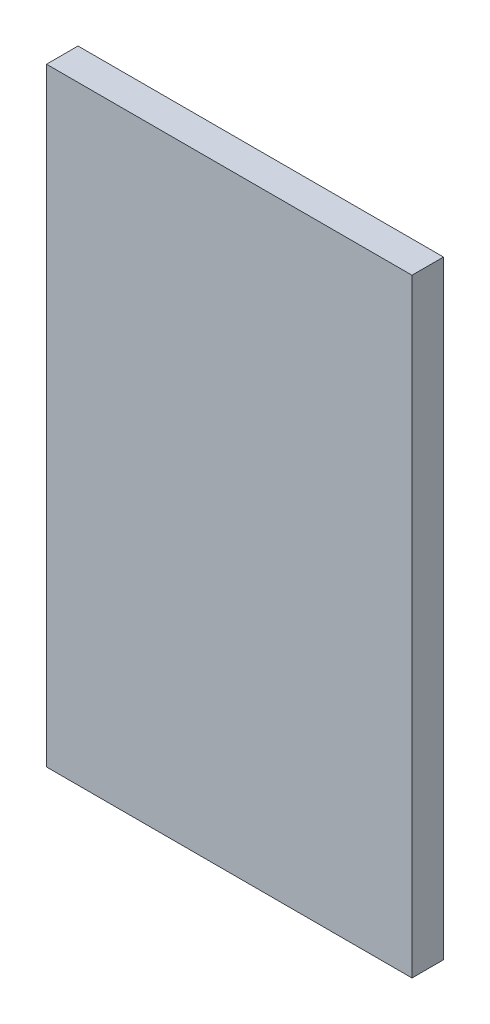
ISO-10303-21;
HEADER;
FILE_DESCRIPTION(('STEP AP214'),'2;1');
FILE_NAME('part.step','',(''),(''),'','','');
FILE_SCHEMA(('AUTOMOTIVE_DESIGN { 1 0 10303 214 1 1 1 1 }'));
ENDSEC;
DATA;
#1=APPLICATION_CONTEXT('core data for automotive mechanical design processes');
#2=APPLICATION_PROTOCOL_DEFINITION('international standard','automotive_design',2000,#1);
#3=PRODUCT_CONTEXT('',#1,'mechanical');
#4=PRODUCT('Part','Part','',(#3));
#5=PRODUCT_RELATED_PRODUCT_CATEGORY('part','',(#4));
#6=PRODUCT_DEFINITION_FORMATION('','',#4);
#7=PRODUCT_DEFINITION_CONTEXT('part definition',#1,'design');
#8=PRODUCT_DEFINITION('design','',#6,#7);
#9=PRODUCT_DEFINITION_SHAPE('','',#8);
#10=(LENGTH_UNIT() NAMED_UNIT(*) SI_UNIT(.MILLI.,.METRE.));
#11=(NAMED_UNIT(*) PLANE_ANGLE_UNIT() SI_UNIT($,.RADIAN.));
#12=(NAMED_UNIT(*) SI_UNIT($,.STERADIAN.) SOLID_ANGLE_UNIT());
#13=UNCERTAINTY_MEASURE_WITH_UNIT(LENGTH_MEASURE(1.E-05),#10,'distance_accuracy_value','');
#14=(GEOMETRIC_REPRESENTATION_CONTEXT(3) GLOBAL_UNCERTAINTY_ASSIGNED_CONTEXT((#13)) GLOBAL_UNIT_ASSIGNED_CONTEXT((#10,
#11,#12)) REPRESENTATION_CONTEXT('',''));
#15=CARTESIAN_POINT('',(0.,0.,0.));
#16=DIRECTION('',(0.,0.,1.));
#17=DIRECTION('',(1.,0.,0.));
#18=AXIS2_PLACEMENT_3D('',#15,#16,#17);
#19=CARTESIAN_POINT('',(59.15,98.5,5.1));
#20=DIRECTION('',(-1.,0.,0.));
#21=DIRECTION('',(0.,-1.,0.));
#22=AXIS2_PLACEMENT_3D('',#19,#20,#21);
#23=PLANE('',#22);
#24=DIRECTION('',(0.,1.,0.));
#25=VECTOR('',#24,1.);
#26=CARTESIAN_POINT('',(59.15,98.5,-5.1));
#27=LINE('',#26,#25);
#28=CARTESIAN_POINT('',(59.15,-98.5,-5.1));
#29=VERTEX_POINT('',#28);
#30=CARTESIAN_POINT('',(59.15,98.5,-5.1));
#31=VERTEX_POINT('',#30);
#32=EDGE_CURVE('E95',#29,#31,#27,.T.);
#33=ORIENTED_EDGE('',*,*,#32,.T.);
#34=DIRECTION('',(0.,0.,-1.));
#35=VECTOR('',#34,1.);
#36=CARTESIAN_POINT('',(59.15,98.5,5.1));
#37=LINE('',#36,#35);
#38=CARTESIAN_POINT('',(59.15,98.5,5.1));
#39=VERTEX_POINT('',#38);
#40=EDGE_CURVE('E11',#39,#31,#37,.T.);
#41=ORIENTED_EDGE('',*,*,#40,.F.);
#42=DIRECTION('',(0.,1.,0.));
#43=VECTOR('',#42,1.);
#44=CARTESIAN_POINT('',(59.15,98.5,5.1));
#45=LINE('',#44,#43);
#46=CARTESIAN_POINT('',(59.15,-98.5,5.1));
#47=VERTEX_POINT('',#46);
#48=EDGE_CURVE('E83',#47,#39,#45,.T.);
#49=ORIENTED_EDGE('',*,*,#48,.F.);
#50=DIRECTION('',(0.,0.,-1.));
#51=VECTOR('',#50,1.);
#52=CARTESIAN_POINT('',(59.15,-98.5,5.1));
#53=LINE('',#52,#51);
#54=EDGE_CURVE('E91',#47,#29,#53,.T.);
#55=ORIENTED_EDGE('',*,*,#54,.T.);
#56=EDGE_LOOP('',(#33,#41,#49,#55));
#57=FACE_BOUND('',#56,.T.);
#58=ADVANCED_FACE('F32',(#57),#23,.F.);
#59=CARTESIAN_POINT('',(-59.15,98.5,5.1));
#60=DIRECTION('',(0.,-1.,0.));
#61=DIRECTION('',(0.,0.,-1.));
#62=AXIS2_PLACEMENT_3D('',#59,#60,#61);
#63=PLANE('',#62);
#64=DIRECTION('',(-1.,0.,0.));
#65=VECTOR('',#64,1.);
#66=CARTESIAN_POINT('',(-59.15,98.5,-5.1));
#67=LINE('',#66,#65);
#68=CARTESIAN_POINT('',(-59.15,98.5,-5.1));
#69=VERTEX_POINT('',#68);
#70=EDGE_CURVE('E87',#31,#69,#67,.T.);
#71=ORIENTED_EDGE('',*,*,#70,.T.);
#72=DIRECTION('',(0.,0.,-1.));
#73=VECTOR('',#72,1.);
#74=CARTESIAN_POINT('',(-59.15,98.5,5.1));
#75=LINE('',#74,#73);
#76=CARTESIAN_POINT('',(-59.15,98.5,5.1));
#77=VERTEX_POINT('',#76);
#78=EDGE_CURVE('E40',#77,#69,#75,.T.);
#79=ORIENTED_EDGE('',*,*,#78,.F.);
#80=DIRECTION('',(-1.,0.,0.));
#81=VECTOR('',#80,1.);
#82=CARTESIAN_POINT('',(-59.15,98.5,5.1));
#83=LINE('',#82,#81);
#84=EDGE_CURVE('E78',#39,#77,#83,.T.);
#85=ORIENTED_EDGE('',*,*,#84,.F.);
#86=ORIENTED_EDGE('',*,*,#40,.T.);
#87=EDGE_LOOP('',(#71,#79,#85,#86));
#88=FACE_BOUND('',#87,.T.);
#89=ADVANCED_FACE('F86',(#88),#63,.F.);
#90=CARTESIAN_POINT('',(-59.15,98.5,5.1));
#91=DIRECTION('',(1.,0.,0.));
#92=DIRECTION('',(0.,1.,0.));
#93=AXIS2_PLACEMENT_3D('',#90,#91,#92);
#94=PLANE('',#93);
#95=DIRECTION('',(0.,-1.,0.));
#96=VECTOR('',#95,1.);
#97=CARTESIAN_POINT('',(-59.15,98.5,-5.1));
#98=LINE('',#97,#96);
#99=CARTESIAN_POINT('',(-59.15,-98.5,-5.1));
#100=VERTEX_POINT('',#99);
#101=EDGE_CURVE('E65',#69,#100,#98,.T.);
#102=ORIENTED_EDGE('',*,*,#101,.T.);
#103=DIRECTION('',(0.,0.,-1.));
#104=VECTOR('',#103,1.);
#105=CARTESIAN_POINT('',(-59.15,-98.5,5.1));
#106=LINE('',#105,#104);
#107=CARTESIAN_POINT('',(-59.15,-98.5,5.1));
#108=VERTEX_POINT('',#107);
#109=EDGE_CURVE('E88',#108,#100,#106,.T.);
#110=ORIENTED_EDGE('',*,*,#109,.F.);
#111=DIRECTION('',(0.,-1.,0.));
#112=VECTOR('',#111,1.);
#113=CARTESIAN_POINT('',(-59.15,98.5,5.1));
#114=LINE('',#113,#112);
#115=EDGE_CURVE('E81',#77,#108,#114,.T.);
#116=ORIENTED_EDGE('',*,*,#115,.F.);
#117=ORIENTED_EDGE('',*,*,#78,.T.);
#118=EDGE_LOOP('',(#102,#110,#116,#117));
#119=FACE_BOUND('',#118,.T.);
#120=ADVANCED_FACE('F89',(#119),#94,.F.);
#121=CARTESIAN_POINT('',(-59.15,-98.5,5.1));
#122=DIRECTION('',(0.,1.,0.));
#123=DIRECTION('',(0.,0.,1.));
#124=AXIS2_PLACEMENT_3D('',#121,#122,#123);
#125=PLANE('',#124);
#126=DIRECTION('',(1.,0.,0.));
#127=VECTOR('',#126,1.);
#128=CARTESIAN_POINT('',(-59.15,-98.5,-5.1));
#129=LINE('',#128,#127);
#130=EDGE_CURVE('E71',#100,#29,#129,.T.);
#131=ORIENTED_EDGE('',*,*,#130,.T.);
#132=ORIENTED_EDGE('',*,*,#54,.F.);
#133=DIRECTION('',(1.,0.,0.));
#134=VECTOR('',#133,1.);
#135=CARTESIAN_POINT('',(-59.15,-98.5,5.1));
#136=LINE('',#135,#134);
#137=EDGE_CURVE('E48',#108,#47,#136,.T.);
#138=ORIENTED_EDGE('',*,*,#137,.F.);
#139=ORIENTED_EDGE('',*,*,#109,.T.);
#140=EDGE_LOOP('',(#131,#132,#138,#139));
#141=FACE_BOUND('',#140,.T.);
#142=ADVANCED_FACE('F102',(#141),#125,.F.);
#143=CARTESIAN_POINT('',(0.,0.,5.1));
#144=DIRECTION('',(0.,0.,1.));
#145=DIRECTION('',(1.,0.,0.));
#146=AXIS2_PLACEMENT_3D('',#143,#144,#145);
#147=PLANE('',#146);
#148=ORIENTED_EDGE('',*,*,#48,.T.);
#149=ORIENTED_EDGE('',*,*,#84,.T.);
#150=ORIENTED_EDGE('',*,*,#115,.T.);
#151=ORIENTED_EDGE('',*,*,#137,.T.);
#152=EDGE_LOOP('',(#148,#149,#150,#151));
#153=FACE_BOUND('',#152,.T.);
#154=ADVANCED_FACE('F79',(#153),#147,.T.);
#155=CARTESIAN_POINT('',(0.,0.,-5.1));
#156=DIRECTION('',(0.,0.,1.));
#157=DIRECTION('',(1.,0.,0.));
#158=AXIS2_PLACEMENT_3D('',#155,#156,#157);
#159=PLANE('',#158);
#160=ORIENTED_EDGE('',*,*,#32,.F.);
#161=ORIENTED_EDGE('',*,*,#130,.F.);
#162=ORIENTED_EDGE('',*,*,#101,.F.);
#163=ORIENTED_EDGE('',*,*,#70,.F.);
#164=EDGE_LOOP('',(#160,#161,#162,#163));
#165=FACE_BOUND('',#164,.T.);
#166=ADVANCED_FACE('F105',(#165),#159,.F.);
#167=CLOSED_SHELL('',(#58,#89,#120,#142,#154,#166));
#168=MANIFOLD_SOLID_BREP('B2',#167);
#169=ADVANCED_BREP_SHAPE_REPRESENTATION('',(#18,#168),#14);
#170=SHAPE_DEFINITION_REPRESENTATION(#9,#169);
ENDSEC;
END-ISO-10303-21;
